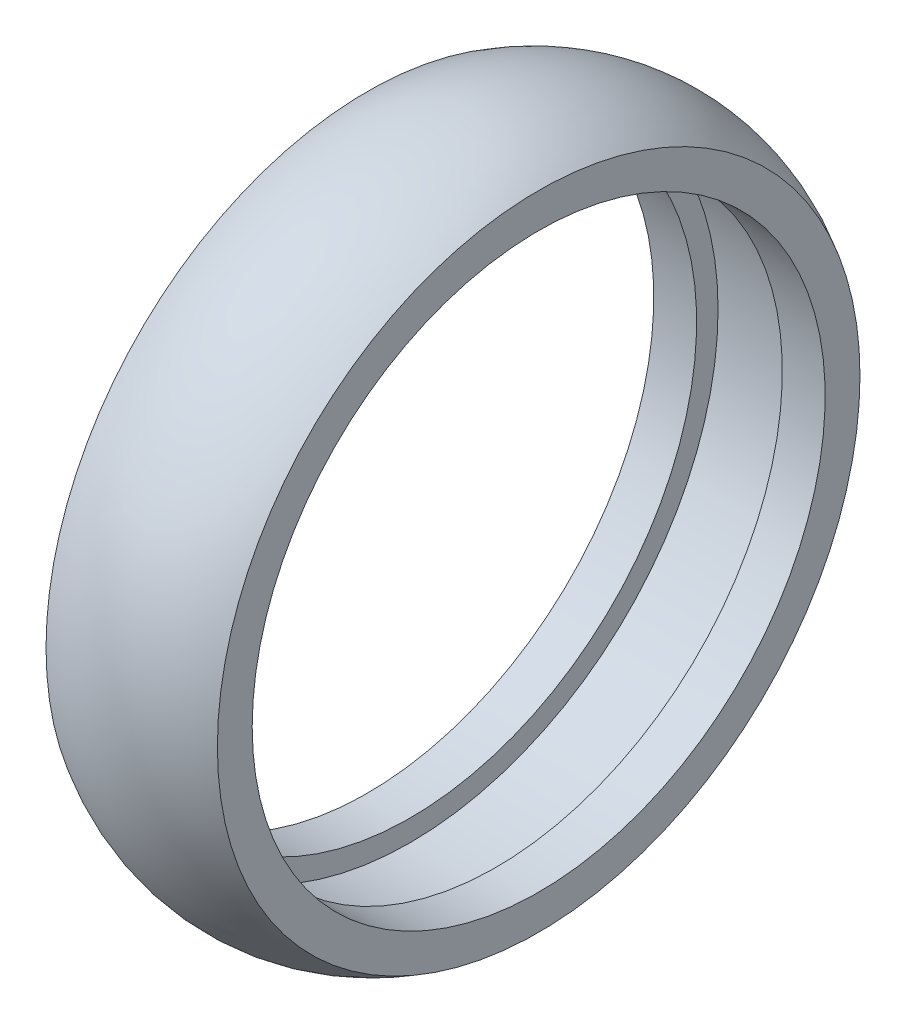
ISO-10303-21;
HEADER;
FILE_DESCRIPTION(('STEP AP214'),'2;1');
FILE_NAME('part.step','',(''),(''),'','','');
FILE_SCHEMA(('AUTOMOTIVE_DESIGN { 1 0 10303 214 1 1 1 1 }'));
ENDSEC;
DATA;
#1=APPLICATION_CONTEXT('core data for automotive mechanical design processes');
#2=APPLICATION_PROTOCOL_DEFINITION('international standard','automotive_design',2000,#1);
#3=PRODUCT_CONTEXT('',#1,'mechanical');
#4=PRODUCT('Part','Part','',(#3));
#5=PRODUCT_RELATED_PRODUCT_CATEGORY('part','',(#4));
#6=PRODUCT_DEFINITION_FORMATION('','',#4);
#7=PRODUCT_DEFINITION_CONTEXT('part definition',#1,'design');
#8=PRODUCT_DEFINITION('design','',#6,#7);
#9=PRODUCT_DEFINITION_SHAPE('','',#8);
#10=(LENGTH_UNIT() NAMED_UNIT(*) SI_UNIT(.MILLI.,.METRE.));
#11=(NAMED_UNIT(*) PLANE_ANGLE_UNIT() SI_UNIT($,.RADIAN.));
#12=(NAMED_UNIT(*) SI_UNIT($,.STERADIAN.) SOLID_ANGLE_UNIT());
#13=UNCERTAINTY_MEASURE_WITH_UNIT(LENGTH_MEASURE(1.E-05),#10,'distance_accuracy_value','');
#14=(GEOMETRIC_REPRESENTATION_CONTEXT(3) GLOBAL_UNCERTAINTY_ASSIGNED_CONTEXT((#13)) GLOBAL_UNIT_ASSIGNED_CONTEXT((#10,
#11,#12)) REPRESENTATION_CONTEXT('',''));
#15=CARTESIAN_POINT('',(0.,0.,0.));
#16=DIRECTION('',(0.,0.,1.));
#17=DIRECTION('',(1.,0.,0.));
#18=AXIS2_PLACEMENT_3D('',#15,#16,#17);
#19=CARTESIAN_POINT('',(0.,0.,0.));
#20=DIRECTION('',(-1.,0.,0.));
#21=DIRECTION('',(0.,0.,1.));
#22=AXIS2_PLACEMENT_3D('',#19,#20,#21);
#23=TOROIDAL_SURFACE('',#22,16.9027777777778,15.3472222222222);
#24=CARTESIAN_POINT('',(-8.,0.,0.));
#25=DIRECTION('',(-1.,0.,0.));
#26=DIRECTION('',(0.,0.,1.));
#27=AXIS2_PLACEMENT_3D('',#24,#25,#26);
#28=CIRCLE('',#27,30.);
#29=CARTESIAN_POINT('',(-8.,0.,30.));
#30=VERTEX_POINT('',#29);
#31=EDGE_CURVE('E10',#30,#30,#28,.T.);
#32=ORIENTED_EDGE('',*,*,#31,.F.);
#33=EDGE_LOOP('',(#32));
#34=FACE_BOUND('',#33,.T.);
#35=CARTESIAN_POINT('',(8.,0.,0.));
#36=DIRECTION('',(-1.,0.,0.));
#37=DIRECTION('',(0.,0.,1.));
#38=AXIS2_PLACEMENT_3D('',#35,#36,#37);
#39=CIRCLE('',#38,30.);
#40=CARTESIAN_POINT('',(8.,0.,30.));
#41=VERTEX_POINT('',#40);
#42=EDGE_CURVE('E58',#41,#41,#39,.T.);
#43=ORIENTED_EDGE('',*,*,#42,.T.);
#44=EDGE_LOOP('',(#43));
#45=FACE_BOUND('',#44,.T.);
#46=ADVANCED_FACE('F30',(#34,#45),#23,.T.);
#47=CARTESIAN_POINT('',(-8.,30.,0.));
#48=DIRECTION('',(1.,0.,0.));
#49=DIRECTION('',(0.,0.,-1.));
#50=AXIS2_PLACEMENT_3D('',#47,#48,#49);
#51=PLANE('',#50);
#52=CARTESIAN_POINT('',(-8.,0.,0.));
#53=DIRECTION('',(-1.,0.,0.));
#54=DIRECTION('',(0.,0.,1.));
#55=AXIS2_PLACEMENT_3D('',#52,#53,#54);
#56=CIRCLE('',#55,26.75);
#57=CARTESIAN_POINT('',(-8.,0.,26.75));
#58=VERTEX_POINT('',#57);
#59=EDGE_CURVE('E36',#58,#58,#56,.T.);
#60=ORIENTED_EDGE('',*,*,#59,.F.);
#61=EDGE_LOOP('',(#60));
#62=FACE_BOUND('',#61,.T.);
#63=ORIENTED_EDGE('',*,*,#31,.T.);
#64=EDGE_LOOP('',(#63));
#65=FACE_BOUND('',#64,.T.);
#66=ADVANCED_FACE('F95',(#62,#65),#51,.F.);
#67=CARTESIAN_POINT('',(0.,0.,0.));
#68=DIRECTION('',(-1.,0.,0.));
#69=DIRECTION('',(0.,0.,1.));
#70=AXIS2_PLACEMENT_3D('',#67,#68,#69);
#71=CYLINDRICAL_SURFACE('',#70,26.75);
#72=CARTESIAN_POINT('',(-4.,0.,0.));
#73=DIRECTION('',(-1.,0.,0.));
#74=DIRECTION('',(0.,0.,1.));
#75=AXIS2_PLACEMENT_3D('',#72,#73,#74);
#76=CIRCLE('',#75,26.75);
#77=CARTESIAN_POINT('',(-4.,0.,26.75));
#78=VERTEX_POINT('',#77);
#79=EDGE_CURVE('E40',#78,#78,#76,.T.);
#80=ORIENTED_EDGE('',*,*,#79,.F.);
#81=EDGE_LOOP('',(#80));
#82=FACE_BOUND('',#81,.T.);
#83=ORIENTED_EDGE('',*,*,#59,.T.);
#84=EDGE_LOOP('',(#83));
#85=FACE_BOUND('',#84,.T.);
#86=ADVANCED_FACE('F90',(#82,#85),#71,.F.);
#87=CARTESIAN_POINT('',(-4.,26.75,0.));
#88=DIRECTION('',(-1.,0.,0.));
#89=DIRECTION('',(0.,0.,1.));
#90=AXIS2_PLACEMENT_3D('',#87,#88,#89);
#91=PLANE('',#90);
#92=CARTESIAN_POINT('',(-4.,0.,0.));
#93=DIRECTION('',(-1.,0.,0.));
#94=DIRECTION('',(0.,0.,1.));
#95=AXIS2_PLACEMENT_3D('',#92,#93,#94);
#96=CIRCLE('',#95,28.75);
#97=CARTESIAN_POINT('',(-4.,0.,28.75));
#98=VERTEX_POINT('',#97);
#99=EDGE_CURVE('E44',#98,#98,#96,.T.);
#100=ORIENTED_EDGE('',*,*,#99,.F.);
#101=EDGE_LOOP('',(#100));
#102=FACE_BOUND('',#101,.T.);
#103=ORIENTED_EDGE('',*,*,#79,.T.);
#104=EDGE_LOOP('',(#103));
#105=FACE_BOUND('',#104,.T.);
#106=ADVANCED_FACE('F84',(#102,#105),#91,.F.);
#107=CARTESIAN_POINT('',(0.,0.,0.));
#108=DIRECTION('',(-1.,0.,0.));
#109=DIRECTION('',(0.,0.,1.));
#110=AXIS2_PLACEMENT_3D('',#107,#108,#109);
#111=CYLINDRICAL_SURFACE('',#110,28.75);
#112=CARTESIAN_POINT('',(4.,0.,0.));
#113=DIRECTION('',(-1.,0.,0.));
#114=DIRECTION('',(0.,0.,1.));
#115=AXIS2_PLACEMENT_3D('',#112,#113,#114);
#116=CIRCLE('',#115,28.75);
#117=CARTESIAN_POINT('',(4.,0.,28.75));
#118=VERTEX_POINT('',#117);
#119=EDGE_CURVE('E49',#118,#118,#116,.T.);
#120=ORIENTED_EDGE('',*,*,#119,.F.);
#121=EDGE_LOOP('',(#120));
#122=FACE_BOUND('',#121,.T.);
#123=ORIENTED_EDGE('',*,*,#99,.T.);
#124=EDGE_LOOP('',(#123));
#125=FACE_BOUND('',#124,.T.);
#126=ADVANCED_FACE('F78',(#122,#125),#111,.F.);
#127=CARTESIAN_POINT('',(4.,28.75,0.));
#128=DIRECTION('',(1.,0.,0.));
#129=DIRECTION('',(0.,0.,-1.));
#130=AXIS2_PLACEMENT_3D('',#127,#128,#129);
#131=PLANE('',#130);
#132=CARTESIAN_POINT('',(4.,0.,0.));
#133=DIRECTION('',(-1.,0.,0.));
#134=DIRECTION('',(0.,0.,1.));
#135=AXIS2_PLACEMENT_3D('',#132,#133,#134);
#136=CIRCLE('',#135,26.75);
#137=CARTESIAN_POINT('',(4.,0.,26.75));
#138=VERTEX_POINT('',#137);
#139=EDGE_CURVE('E52',#138,#138,#136,.T.);
#140=ORIENTED_EDGE('',*,*,#139,.F.);
#141=EDGE_LOOP('',(#140));
#142=FACE_BOUND('',#141,.T.);
#143=ORIENTED_EDGE('',*,*,#119,.T.);
#144=EDGE_LOOP('',(#143));
#145=FACE_BOUND('',#144,.T.);
#146=ADVANCED_FACE('F72',(#142,#145),#131,.F.);
#147=CARTESIAN_POINT('',(0.,0.,0.));
#148=DIRECTION('',(-1.,0.,0.));
#149=DIRECTION('',(0.,0.,1.));
#150=AXIS2_PLACEMENT_3D('',#147,#148,#149);
#151=CYLINDRICAL_SURFACE('',#150,26.75);
#152=CARTESIAN_POINT('',(8.,0.,0.));
#153=DIRECTION('',(-1.,0.,0.));
#154=DIRECTION('',(0.,0.,1.));
#155=AXIS2_PLACEMENT_3D('',#152,#153,#154);
#156=CIRCLE('',#155,26.75);
#157=CARTESIAN_POINT('',(8.,0.,26.75));
#158=VERTEX_POINT('',#157);
#159=EDGE_CURVE('E55',#158,#158,#156,.T.);
#160=ORIENTED_EDGE('',*,*,#159,.F.);
#161=EDGE_LOOP('',(#160));
#162=FACE_BOUND('',#161,.T.);
#163=ORIENTED_EDGE('',*,*,#139,.T.);
#164=EDGE_LOOP('',(#163));
#165=FACE_BOUND('',#164,.T.);
#166=ADVANCED_FACE('F66',(#162,#165),#151,.F.);
#167=CARTESIAN_POINT('',(8.,26.75,0.));
#168=DIRECTION('',(-1.,0.,0.));
#169=DIRECTION('',(0.,0.,1.));
#170=AXIS2_PLACEMENT_3D('',#167,#168,#169);
#171=PLANE('',#170);
#172=ORIENTED_EDGE('',*,*,#42,.F.);
#173=EDGE_LOOP('',(#172));
#174=FACE_BOUND('',#173,.T.);
#175=ORIENTED_EDGE('',*,*,#159,.T.);
#176=EDGE_LOOP('',(#175));
#177=FACE_BOUND('',#176,.T.);
#178=ADVANCED_FACE('F63',(#174,#177),#171,.F.);
#179=CLOSED_SHELL('',(#46,#66,#86,#106,#126,#146,#166,#178));
#180=MANIFOLD_SOLID_BREP('B2',#179);
#181=ADVANCED_BREP_SHAPE_REPRESENTATION('',(#18,#180),#14);
#182=SHAPE_DEFINITION_REPRESENTATION(#9,#181);
ENDSEC;
END-ISO-10303-21;
